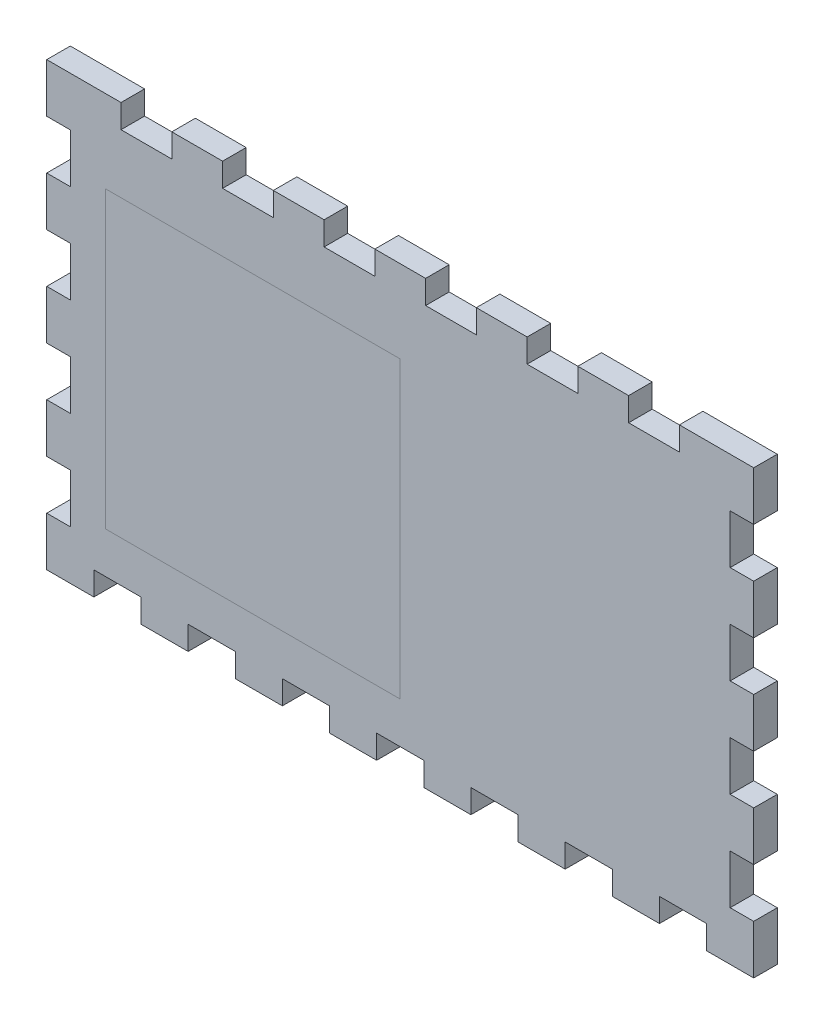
from build123d import *

# Parameters (mm, degrees)
BOSS_EXTRUDE1_DEPTH = 4


with BuildPart() as part:
    # Model → Boss-Extrude1 (new body)
    with BuildSketch(Plane.XY):
        Polygon((91.61, 278), (83, 278), (79, 278), (79, 269.67), (83, 269.67), (83, 261.33), (79, 261.33), (79, 253), (83, 253), (83, 244.67), (79, 244.67), (79, 236.33), (83, 236.33), (83, 228), (79, 228), (79, 219.67), (83, 219.67), (83, 211.33), (79, 211.33), (79, 203), (87, 203), (87, 207), (95, 207), (95, 203), (103, 203), (103, 207), (111, 207), (111, 203), (119, 203), (119, 207), (127, 207), (127, 203), (135, 203), (135, 207), (143, 207), (143, 203), (151, 203), (151, 207), (159, 207), (159, 203), (167, 203), (167, 207), (175, 207), (175, 203), (183, 203), (183, 207), (191, 207), (191, 203), (199, 203), (199, 211.33), (195, 211.33), (195, 219.67), (199, 219.67), (199, 228), (195, 228), (195, 236.33), (199, 236.33), (199, 244.67), (195, 244.67), (195, 253), (199, 253), (199, 261.33), (195, 261.33), (195, 269.67), (199, 269.67), (199, 278), (195, 278), (186.38, 278), (186.38, 274), (177.77, 274), (177.77, 278), (169.15, 278), (169.15, 274), (160.54, 274), (160.54, 278), (151.92, 278), (151.92, 274), (143.31, 274), (143.31, 278), (134.69, 278), (134.69, 274), (126.08, 274), (126.08, 278), (117.46, 278), (117.46, 274), (108.85, 274), (108.85, 278), (100.23, 278), (100.23, 274), (91.61, 274), align=None)
    extrude(amount=BOSS_EXTRUDE1_DEPTH)


solid = part.part
